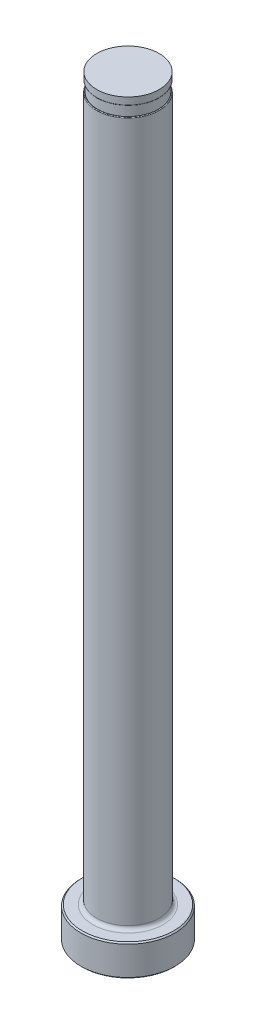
from build123d import *

# Parameters (mm, degrees)
CHAMFER1_SIZE     = 0.254
FILLET1_R         = 0.762
SKETCH2_W         = 0.2032
SKETCH2_H         = 2.032
D_SLOT_DEPTH      = 153.9941543
D_SLOT_DEPTH_BACK = 153.9941543
SKETCH5_W         = 0.0254
SKETCH5_H         = 1.524
FILLET2_R         = 0.127


with BuildPart() as part:
    # Sketch1 → Revolve1 (revolve)
    with BuildSketch(Plane.XY, mode=Mode.PRIVATE) as revolve1_sk:
        Polygon((0, 0), (-9.525, 0), (-9.525, 6.35), (-6.35, 6.35), (-6.35, 152.4), (0, 152.4), align=None)
    revolve(revolve1_sk.sketch.rotate(Axis((0, 259.958771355, 0), (0, -1, 0)), 270), axis=Axis((0, 259.958771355, 0), (0, -1, 0)))

    # Chamfer1
    chamfer1_edges = [part.edges().sort_by_distance(p)[0] for p in [
        (0, 6.35, -9.525),
        (0, 0, -9.525),
    ]]
    chamfer(chamfer1_edges, length=CHAMFER1_SIZE)

    # Fillet1
    fillet1_edges = [part.edges().sort_by_distance(p)[0] for p in [
        (0, 6.35, -6.35),
    ]]
    fillet(fillet1_edges, radius=FILLET1_R)

    # Sketch2 → Vent Relief (revolve, cut)
    with BuildSketch(Plane.XY, mode=Mode.PRIVATE) as vent_relief_sk:
        with Locations((-6.2484, 149.86)):
            Rectangle(SKETCH2_W, SKETCH2_H)
    revolve(vent_relief_sk.sketch.rotate(Axis((0, 153.448281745, 0), (0, -1, 0)), 270), axis=Axis((0, 153.448281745, 0), (0, -1, 0)), mode=Mode.SUBTRACT)

    # Sketch3 → D-Slot (cut, two sides: drawn at the far end of the back side and taken through both)
    with BuildSketch(Plane.XY.offset(-D_SLOT_DEPTH_BACK)):
        with BuildLine():
            Line((-6.1468, 149.86), (-6.1468, 86.36))
            ThreePointArc((-6.1468, 86.36), (-6.198013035, 85.792038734), (-6.35, 85.2424))
            Line((-6.35, 85.2424), (-6.35, 149.86))
            Line((-6.35, 149.86), (-6.1468, 149.86))
        make_face()
    extrude(amount=D_SLOT_DEPTH + D_SLOT_DEPTH_BACK, mode=Mode.SUBTRACT)

    # Sketch5 → Vent Diameter (revolve, cut)
    with BuildSketch(Plane.XY, mode=Mode.PRIVATE) as vent_diameter_sk:
        with Locations((-6.3373, 151.638)):
            Rectangle(SKETCH5_W, SKETCH5_H)
    revolve(vent_diameter_sk.sketch.rotate(Axis((0, 152.687735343, 0), (0, -1, 0)), 90), axis=Axis((0, 152.687735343, 0), (0, -1, 0)), mode=Mode.SUBTRACT)

    # Fillet2
    fillet2_edges = [part.edges().sort_by_distance(p)[0] for p in [
        (5.022023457, 148.844, -3.886100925),
        (0, 150.876, 6.3246),
    ]]
    fillet(fillet2_edges, radius=FILLET2_R)


solid = part.part
